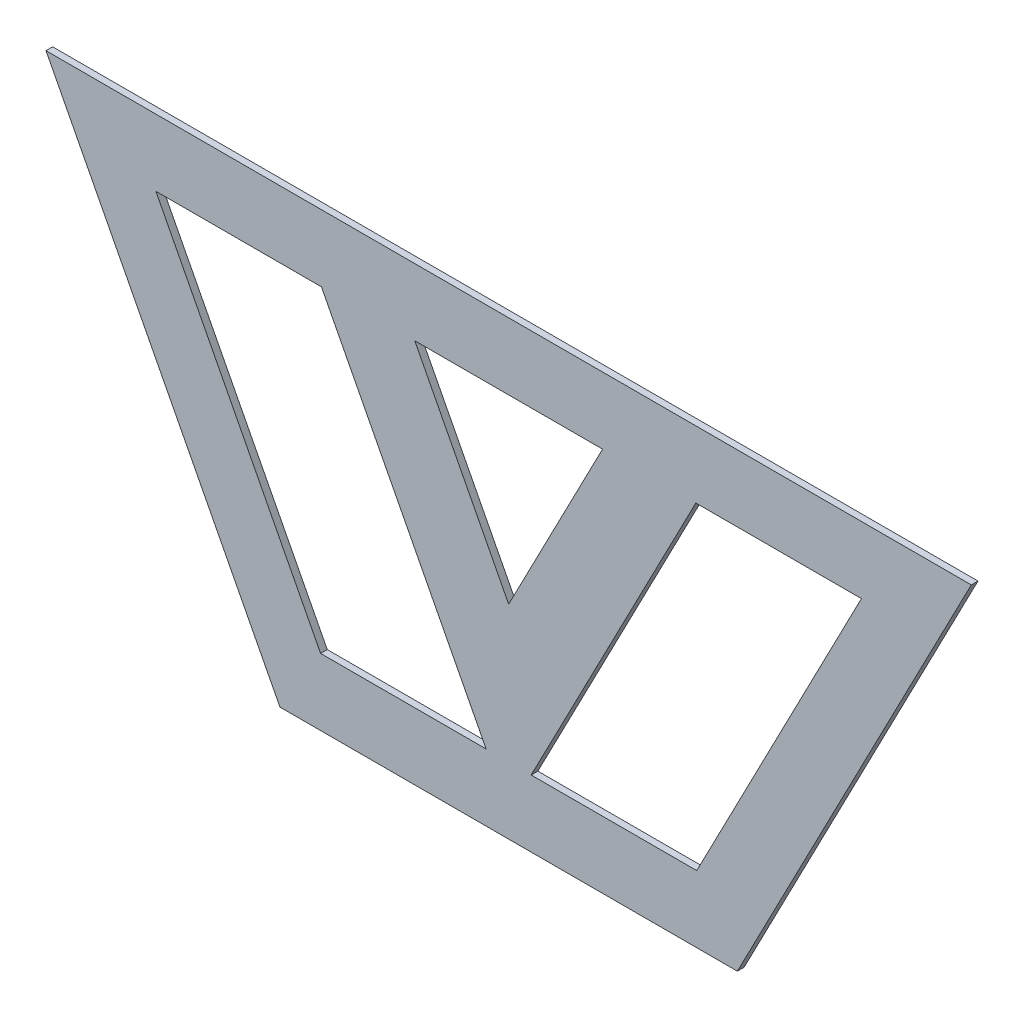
ISO-10303-21;
HEADER;
FILE_DESCRIPTION(('STEP AP214'),'2;1');
FILE_NAME('part.step','',(''),(''),'','','');
FILE_SCHEMA(('AUTOMOTIVE_DESIGN { 1 0 10303 214 1 1 1 1 }'));
ENDSEC;
DATA;
#1=APPLICATION_CONTEXT('core data for automotive mechanical design processes');
#2=APPLICATION_PROTOCOL_DEFINITION('international standard','automotive_design',2000,#1);
#3=PRODUCT_CONTEXT('',#1,'mechanical');
#4=PRODUCT('Part','Part','',(#3));
#5=PRODUCT_RELATED_PRODUCT_CATEGORY('part','',(#4));
#6=PRODUCT_DEFINITION_FORMATION('','',#4);
#7=PRODUCT_DEFINITION_CONTEXT('part definition',#1,'design');
#8=PRODUCT_DEFINITION('design','',#6,#7);
#9=PRODUCT_DEFINITION_SHAPE('','',#8);
#10=(LENGTH_UNIT() NAMED_UNIT(*) SI_UNIT(.MILLI.,.METRE.));
#11=(NAMED_UNIT(*) PLANE_ANGLE_UNIT() SI_UNIT($,.RADIAN.));
#12=(NAMED_UNIT(*) SI_UNIT($,.STERADIAN.) SOLID_ANGLE_UNIT());
#13=UNCERTAINTY_MEASURE_WITH_UNIT(LENGTH_MEASURE(1.E-05),#10,'distance_accuracy_value','');
#14=(GEOMETRIC_REPRESENTATION_CONTEXT(3) GLOBAL_UNCERTAINTY_ASSIGNED_CONTEXT((#13)) GLOBAL_UNIT_ASSIGNED_CONTEXT((#10,
#11,#12)) REPRESENTATION_CONTEXT('',''));
#15=CARTESIAN_POINT('',(0.,0.,0.));
#16=DIRECTION('',(0.,0.,1.));
#17=DIRECTION('',(1.,0.,0.));
#18=AXIS2_PLACEMENT_3D('',#15,#16,#17);
#19=CARTESIAN_POINT('',(0.,0.,6.35));
#20=DIRECTION('',(0.,0.,-1.));
#21=DIRECTION('',(-1.,0.,0.));
#22=AXIS2_PLACEMENT_3D('',#19,#20,#21);
#23=PLANE('',#22);
#24=DIRECTION('',(-1.,0.,0.));
#25=VECTOR('',#24,1.);
#26=CARTESIAN_POINT('',(139.044538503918,978.055735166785,6.35));
#27=LINE('',#26,#25);
#28=CARTESIAN_POINT('',(296.382731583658,978.055735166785,6.35));
#29=VERTEX_POINT('',#28);
#30=CARTESIAN_POINT('',(139.044538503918,978.055735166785,6.35));
#31=VERTEX_POINT('',#30);
#32=EDGE_CURVE('E212',#29,#31,#27,.T.);
#33=ORIENTED_EDGE('',*,*,#32,.F.);
#34=DIRECTION('',(0.460043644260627,0.887896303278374,0.));
#35=VECTOR('',#34,1.);
#36=CARTESIAN_POINT('',(139.867382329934,675.977004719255,6.35));
#37=LINE('',#36,#35);
#38=CARTESIAN_POINT('',(139.867382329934,675.977004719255,6.35));
#39=VERTEX_POINT('',#38);
#40=EDGE_CURVE('E223',#39,#29,#37,.T.);
#41=ORIENTED_EDGE('',*,*,#40,.F.);
#42=DIRECTION('',(1.,0.,0.));
#43=VECTOR('',#42,1.);
#44=CARTESIAN_POINT('',(139.867382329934,675.977004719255,6.35));
#45=LINE('',#44,#43);
#46=CARTESIAN_POINT('',(-17.4708107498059,675.977004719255,6.35));
#47=VERTEX_POINT('',#46);
#48=EDGE_CURVE('E219',#47,#39,#45,.T.);
#49=ORIENTED_EDGE('',*,*,#48,.F.);
#50=DIRECTION('',(-0.460043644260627,-0.887896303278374,0.));
#51=VECTOR('',#50,1.);
#52=CARTESIAN_POINT('',(-17.4708107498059,675.977004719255,6.35));
#53=LINE('',#52,#51);
#54=EDGE_CURVE('E215',#31,#47,#53,.T.);
#55=ORIENTED_EDGE('',*,*,#54,.F.);
#56=EDGE_LOOP('',(#33,#41,#49,#55));
#57=FACE_BOUND('',#56,.T.);
#58=DIRECTION('',(0.460043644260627,0.887896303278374,0.));
#59=VECTOR('',#58,1.);
#60=CARTESIAN_POINT('',(178.48363567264,612.477004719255,6.35));
#61=LINE('',#60,#59);
#62=CARTESIAN_POINT('',(178.48363567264,612.477004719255,6.35));
#63=VERTEX_POINT('',#62);
#64=CARTESIAN_POINT('',(400.801199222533,1041.55573516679,6.35));
#65=VERTEX_POINT('',#64);
#66=EDGE_CURVE('E298',#63,#65,#61,.T.);
#67=ORIENTED_EDGE('',*,*,#66,.T.);
#68=DIRECTION('',(-1.,0.,0.));
#69=VECTOR('',#68,1.);
#70=CARTESIAN_POINT('',(-478.533831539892,1041.55573516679,6.35));
#71=LINE('',#70,#69);
#72=CARTESIAN_POINT('',(-478.533831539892,1041.55573516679,6.35));
#73=VERTEX_POINT('',#72);
#74=EDGE_CURVE('E302',#65,#73,#71,.T.);
#75=ORIENTED_EDGE('',*,*,#74,.T.);
#76=DIRECTION('',(0.460043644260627,-0.887896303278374,0.));
#77=VECTOR('',#76,1.);
#78=CARTESIAN_POINT('',(-256.216267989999,612.477004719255,6.35));
#79=LINE('',#78,#77);
#80=CARTESIAN_POINT('',(-256.216267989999,612.477004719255,6.35));
#81=VERTEX_POINT('',#80);
#82=EDGE_CURVE('E306',#73,#81,#79,.T.);
#83=ORIENTED_EDGE('',*,*,#82,.T.);
#84=DIRECTION('',(1.,0.,0.));
#85=VECTOR('',#84,1.);
#86=CARTESIAN_POINT('',(178.48363567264,612.477004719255,6.35));
#87=LINE('',#86,#85);
#88=EDGE_CURVE('E309',#81,#63,#87,.T.);
#89=ORIENTED_EDGE('',*,*,#88,.T.);
#90=EDGE_LOOP('',(#67,#75,#83,#89));
#91=FACE_BOUND('',#90,.T.);
#92=DIRECTION('',(1.,0.,0.));
#93=VECTOR('',#92,1.);
#94=CARTESIAN_POINT('',(-60.2618215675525,675.977004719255,6.35));
#95=LINE('',#94,#93);
#96=CARTESIAN_POINT('',(-217.600014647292,675.977004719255,6.35));
#97=VERTEX_POINT('',#96);
#98=CARTESIAN_POINT('',(-60.2618215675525,675.977004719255,6.35));
#99=VERTEX_POINT('',#98);
#100=EDGE_CURVE('E255',#97,#99,#95,.T.);
#101=ORIENTED_EDGE('',*,*,#100,.F.);
#102=DIRECTION('',(0.460043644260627,-0.887896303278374,0.));
#103=VECTOR('',#102,1.);
#104=CARTESIAN_POINT('',(-217.600014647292,675.977004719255,6.35));
#105=LINE('',#104,#103);
#106=CARTESIAN_POINT('',(-374.115363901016,978.055735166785,6.35));
#107=VERTEX_POINT('',#106);
#108=EDGE_CURVE('E266',#107,#97,#105,.T.);
#109=ORIENTED_EDGE('',*,*,#108,.F.);
#110=DIRECTION('',(-1.,0.,0.));
#111=VECTOR('',#110,1.);
#112=CARTESIAN_POINT('',(-374.115363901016,978.055735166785,6.35));
#113=LINE('',#112,#111);
#114=CARTESIAN_POINT('',(-216.777170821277,978.055735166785,6.35));
#115=VERTEX_POINT('',#114);
#116=EDGE_CURVE('E262',#115,#107,#113,.T.);
#117=ORIENTED_EDGE('',*,*,#116,.F.);
#118=DIRECTION('',(-0.460043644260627,0.887896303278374,0.));
#119=VECTOR('',#118,1.);
#120=CARTESIAN_POINT('',(-60.2618215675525,675.977004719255,6.35));
#121=LINE('',#120,#119);
#122=EDGE_CURVE('E258',#99,#115,#121,.T.);
#123=ORIENTED_EDGE('',*,*,#122,.F.);
#124=EDGE_LOOP('',(#101,#109,#117,#123));
#125=FACE_BOUND('',#124,.T.);
#126=DIRECTION('',(0.460043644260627,0.887896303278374,0.));
#127=VECTOR('',#126,1.);
#128=CARTESIAN_POINT('',(-38.8663161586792,805.840791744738,6.35));
#129=LINE('',#128,#127);
#130=CARTESIAN_POINT('',(-38.8663161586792,805.840791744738,6.35));
#131=VERTEX_POINT('',#130);
#132=CARTESIAN_POINT('',(50.3630114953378,978.055735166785,6.35));
#133=VERTEX_POINT('',#132);
#134=EDGE_CURVE('E176',#131,#133,#129,.T.);
#135=ORIENTED_EDGE('',*,*,#134,.F.);
#136=DIRECTION('',(0.460043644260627,-0.887896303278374,0.));
#137=VECTOR('',#136,1.);
#138=CARTESIAN_POINT('',(-38.8663161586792,805.840791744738,6.35));
#139=LINE('',#138,#137);
#140=CARTESIAN_POINT('',(-128.095643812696,978.055735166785,6.35));
#141=VERTEX_POINT('',#140);
#142=EDGE_CURVE('E195',#141,#131,#139,.T.);
#143=ORIENTED_EDGE('',*,*,#142,.F.);
#144=DIRECTION('',(-1.,0.,0.));
#145=VECTOR('',#144,1.);
#146=CARTESIAN_POINT('',(-128.095643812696,978.055735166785,6.35));
#147=LINE('',#146,#145);
#148=EDGE_CURVE('E185',#133,#141,#147,.T.);
#149=ORIENTED_EDGE('',*,*,#148,.F.);
#150=EDGE_LOOP('',(#135,#143,#149));
#151=FACE_BOUND('',#150,.T.);
#152=ADVANCED_FACE('F38',(#57,#91,#125,#151),#23,.F.);
#153=CARTESIAN_POINT('',(0.,0.,0.));
#154=DIRECTION('',(0.,0.,-1.));
#155=DIRECTION('',(-1.,0.,0.));
#156=AXIS2_PLACEMENT_3D('',#153,#154,#155);
#157=PLANE('',#156);
#158=DIRECTION('',(0.460043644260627,0.887896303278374,0.));
#159=VECTOR('',#158,1.);
#160=CARTESIAN_POINT('',(178.48363567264,612.477004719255,0.));
#161=LINE('',#160,#159);
#162=CARTESIAN_POINT('',(178.48363567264,612.477004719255,0.));
#163=VERTEX_POINT('',#162);
#164=CARTESIAN_POINT('',(400.801199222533,1041.55573516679,0.));
#165=VERTEX_POINT('',#164);
#166=EDGE_CURVE('E297',#163,#165,#161,.T.);
#167=ORIENTED_EDGE('',*,*,#166,.F.);
#168=DIRECTION('',(1.,0.,0.));
#169=VECTOR('',#168,1.);
#170=CARTESIAN_POINT('',(178.48363567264,612.477004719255,0.));
#171=LINE('',#170,#169);
#172=CARTESIAN_POINT('',(-256.216267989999,612.477004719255,0.));
#173=VERTEX_POINT('',#172);
#174=EDGE_CURVE('E303',#173,#163,#171,.T.);
#175=ORIENTED_EDGE('',*,*,#174,.F.);
#176=DIRECTION('',(0.460043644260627,-0.887896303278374,0.));
#177=VECTOR('',#176,1.);
#178=CARTESIAN_POINT('',(-256.216267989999,612.477004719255,0.));
#179=LINE('',#178,#177);
#180=CARTESIAN_POINT('',(-478.533831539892,1041.55573516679,0.));
#181=VERTEX_POINT('',#180);
#182=EDGE_CURVE('E319',#181,#173,#179,.T.);
#183=ORIENTED_EDGE('',*,*,#182,.F.);
#184=DIRECTION('',(-1.,0.,0.));
#185=VECTOR('',#184,1.);
#186=CARTESIAN_POINT('',(-478.533831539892,1041.55573516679,0.));
#187=LINE('',#186,#185);
#188=EDGE_CURVE('E316',#165,#181,#187,.T.);
#189=ORIENTED_EDGE('',*,*,#188,.F.);
#190=EDGE_LOOP('',(#167,#175,#183,#189));
#191=FACE_BOUND('',#190,.T.);
#192=DIRECTION('',(0.460043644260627,-0.887896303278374,0.));
#193=VECTOR('',#192,1.);
#194=CARTESIAN_POINT('',(-217.600014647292,675.977004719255,0.));
#195=LINE('',#194,#193);
#196=CARTESIAN_POINT('',(-374.115363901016,978.055735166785,0.));
#197=VERTEX_POINT('',#196);
#198=CARTESIAN_POINT('',(-217.600014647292,675.977004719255,0.));
#199=VERTEX_POINT('',#198);
#200=EDGE_CURVE('E259',#197,#199,#195,.T.);
#201=ORIENTED_EDGE('',*,*,#200,.T.);
#202=DIRECTION('',(1.,0.,0.));
#203=VECTOR('',#202,1.);
#204=CARTESIAN_POINT('',(-60.2618215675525,675.977004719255,0.));
#205=LINE('',#204,#203);
#206=CARTESIAN_POINT('',(-60.2618215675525,675.977004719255,0.));
#207=VERTEX_POINT('',#206);
#208=EDGE_CURVE('E254',#199,#207,#205,.T.);
#209=ORIENTED_EDGE('',*,*,#208,.T.);
#210=DIRECTION('',(-0.460043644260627,0.887896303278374,0.));
#211=VECTOR('',#210,1.);
#212=CARTESIAN_POINT('',(-60.2618215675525,675.977004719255,0.));
#213=LINE('',#212,#211);
#214=CARTESIAN_POINT('',(-216.777170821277,978.055735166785,0.));
#215=VERTEX_POINT('',#214);
#216=EDGE_CURVE('E273',#207,#215,#213,.T.);
#217=ORIENTED_EDGE('',*,*,#216,.T.);
#218=DIRECTION('',(-1.,0.,0.));
#219=VECTOR('',#218,1.);
#220=CARTESIAN_POINT('',(-374.115363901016,978.055735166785,0.));
#221=LINE('',#220,#219);
#222=EDGE_CURVE('E277',#215,#197,#221,.T.);
#223=ORIENTED_EDGE('',*,*,#222,.T.);
#224=EDGE_LOOP('',(#201,#209,#217,#223));
#225=FACE_BOUND('',#224,.T.);
#226=DIRECTION('',(0.460043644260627,0.887896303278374,0.));
#227=VECTOR('',#226,1.);
#228=CARTESIAN_POINT('',(139.867382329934,675.977004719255,0.));
#229=LINE('',#228,#227);
#230=CARTESIAN_POINT('',(139.867382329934,675.977004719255,0.));
#231=VERTEX_POINT('',#230);
#232=CARTESIAN_POINT('',(296.382731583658,978.055735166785,0.));
#233=VERTEX_POINT('',#232);
#234=EDGE_CURVE('E216',#231,#233,#229,.T.);
#235=ORIENTED_EDGE('',*,*,#234,.T.);
#236=DIRECTION('',(-1.,0.,0.));
#237=VECTOR('',#236,1.);
#238=CARTESIAN_POINT('',(139.044538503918,978.055735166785,0.));
#239=LINE('',#238,#237);
#240=CARTESIAN_POINT('',(139.044538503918,978.055735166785,0.));
#241=VERTEX_POINT('',#240);
#242=EDGE_CURVE('E193',#233,#241,#239,.T.);
#243=ORIENTED_EDGE('',*,*,#242,.T.);
#244=DIRECTION('',(-0.460043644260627,-0.887896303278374,0.));
#245=VECTOR('',#244,1.);
#246=CARTESIAN_POINT('',(-17.4708107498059,675.977004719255,0.));
#247=LINE('',#246,#245);
#248=CARTESIAN_POINT('',(-17.4708107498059,675.977004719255,0.));
#249=VERTEX_POINT('',#248);
#250=EDGE_CURVE('E230',#241,#249,#247,.T.);
#251=ORIENTED_EDGE('',*,*,#250,.T.);
#252=DIRECTION('',(1.,0.,0.));
#253=VECTOR('',#252,1.);
#254=CARTESIAN_POINT('',(139.867382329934,675.977004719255,0.));
#255=LINE('',#254,#253);
#256=EDGE_CURVE('E234',#249,#231,#255,.T.);
#257=ORIENTED_EDGE('',*,*,#256,.T.);
#258=EDGE_LOOP('',(#235,#243,#251,#257));
#259=FACE_BOUND('',#258,.T.);
#260=DIRECTION('',(0.460043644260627,-0.887896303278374,0.));
#261=VECTOR('',#260,1.);
#262=CARTESIAN_POINT('',(-38.8663161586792,805.840791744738,0.));
#263=LINE('',#262,#261);
#264=CARTESIAN_POINT('',(-128.095643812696,978.055735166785,0.));
#265=VERTEX_POINT('',#264);
#266=CARTESIAN_POINT('',(-38.8663161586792,805.840791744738,0.));
#267=VERTEX_POINT('',#266);
#268=EDGE_CURVE('E186',#265,#267,#263,.T.);
#269=ORIENTED_EDGE('',*,*,#268,.T.);
#270=DIRECTION('',(0.460043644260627,0.887896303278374,0.));
#271=VECTOR('',#270,1.);
#272=CARTESIAN_POINT('',(-38.8663161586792,805.840791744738,0.));
#273=LINE('',#272,#271);
#274=CARTESIAN_POINT('',(50.3630114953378,978.055735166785,0.));
#275=VERTEX_POINT('',#274);
#276=EDGE_CURVE('E68',#267,#275,#273,.T.);
#277=ORIENTED_EDGE('',*,*,#276,.T.);
#278=DIRECTION('',(-1.,0.,0.));
#279=VECTOR('',#278,1.);
#280=CARTESIAN_POINT('',(-128.095643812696,978.055735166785,0.));
#281=LINE('',#280,#279);
#282=EDGE_CURVE('E191',#275,#265,#281,.T.);
#283=ORIENTED_EDGE('',*,*,#282,.T.);
#284=EDGE_LOOP('',(#269,#277,#283));
#285=FACE_BOUND('',#284,.T.);
#286=ADVANCED_FACE('F342',(#191,#225,#259,#285),#157,.T.);
#287=CARTESIAN_POINT('',(178.48363567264,612.477004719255,6.35));
#288=DIRECTION('',(-0.887896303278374,0.460043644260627,0.));
#289=DIRECTION('',(-0.460043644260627,-0.887896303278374,0.));
#290=AXIS2_PLACEMENT_3D('',#287,#288,#289);
#291=PLANE('',#290);
#292=ORIENTED_EDGE('',*,*,#166,.T.);
#293=DIRECTION('',(0.,0.,-1.));
#294=VECTOR('',#293,1.);
#295=CARTESIAN_POINT('',(400.801199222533,1041.55573516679,6.35));
#296=LINE('',#295,#294);
#297=EDGE_CURVE('E11',#65,#165,#296,.T.);
#298=ORIENTED_EDGE('',*,*,#297,.F.);
#299=ORIENTED_EDGE('',*,*,#66,.F.);
#300=DIRECTION('',(0.,0.,-1.));
#301=VECTOR('',#300,1.);
#302=CARTESIAN_POINT('',(178.48363567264,612.477004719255,6.35));
#303=LINE('',#302,#301);
#304=EDGE_CURVE('E312',#63,#163,#303,.T.);
#305=ORIENTED_EDGE('',*,*,#304,.T.);
#306=EDGE_LOOP('',(#292,#298,#299,#305));
#307=FACE_BOUND('',#306,.T.);
#308=ADVANCED_FACE('F40',(#307),#291,.F.);
#309=CARTESIAN_POINT('',(-478.533831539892,1041.55573516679,6.35));
#310=DIRECTION('',(0.,-1.,0.));
#311=DIRECTION('',(0.,0.,-1.));
#312=AXIS2_PLACEMENT_3D('',#309,#310,#311);
#313=PLANE('',#312);
#314=ORIENTED_EDGE('',*,*,#188,.T.);
#315=DIRECTION('',(0.,0.,-1.));
#316=VECTOR('',#315,1.);
#317=CARTESIAN_POINT('',(-478.533831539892,1041.55573516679,6.35));
#318=LINE('',#317,#316);
#319=EDGE_CURVE('E47',#73,#181,#318,.T.);
#320=ORIENTED_EDGE('',*,*,#319,.F.);
#321=ORIENTED_EDGE('',*,*,#74,.F.);
#322=ORIENTED_EDGE('',*,*,#297,.T.);
#323=EDGE_LOOP('',(#314,#320,#321,#322));
#324=FACE_BOUND('',#323,.T.);
#325=ADVANCED_FACE('F353',(#324),#313,.F.);
#326=CARTESIAN_POINT('',(-256.216267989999,612.477004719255,6.35));
#327=DIRECTION('',(0.887896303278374,0.460043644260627,0.));
#328=DIRECTION('',(-0.460043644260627,0.887896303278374,0.));
#329=AXIS2_PLACEMENT_3D('',#326,#327,#328);
#330=PLANE('',#329);
#331=ORIENTED_EDGE('',*,*,#182,.T.);
#332=DIRECTION('',(0.,0.,-1.));
#333=VECTOR('',#332,1.);
#334=CARTESIAN_POINT('',(-256.216267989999,612.477004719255,6.35));
#335=LINE('',#334,#333);
#336=EDGE_CURVE('E327',#81,#173,#335,.T.);
#337=ORIENTED_EDGE('',*,*,#336,.F.);
#338=ORIENTED_EDGE('',*,*,#82,.F.);
#339=ORIENTED_EDGE('',*,*,#319,.T.);
#340=EDGE_LOOP('',(#331,#337,#338,#339));
#341=FACE_BOUND('',#340,.T.);
#342=ADVANCED_FACE('F336',(#341),#330,.F.);
#343=CARTESIAN_POINT('',(178.48363567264,612.477004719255,6.35));
#344=DIRECTION('',(0.,1.,0.));
#345=DIRECTION('',(0.,0.,1.));
#346=AXIS2_PLACEMENT_3D('',#343,#344,#345);
#347=PLANE('',#346);
#348=ORIENTED_EDGE('',*,*,#174,.T.);
#349=ORIENTED_EDGE('',*,*,#304,.F.);
#350=ORIENTED_EDGE('',*,*,#88,.F.);
#351=ORIENTED_EDGE('',*,*,#336,.T.);
#352=EDGE_LOOP('',(#348,#349,#350,#351));
#353=FACE_BOUND('',#352,.T.);
#354=ADVANCED_FACE('F346',(#353),#347,.F.);
#355=CARTESIAN_POINT('',(-60.2618215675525,675.977004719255,6.35));
#356=DIRECTION('',(0.,1.,0.));
#357=DIRECTION('',(0.,0.,1.));
#358=AXIS2_PLACEMENT_3D('',#355,#356,#357);
#359=PLANE('',#358);
#360=ORIENTED_EDGE('',*,*,#208,.F.);
#361=DIRECTION('',(0.,0.,-1.));
#362=VECTOR('',#361,1.);
#363=CARTESIAN_POINT('',(-217.600014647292,675.977004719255,6.35));
#364=LINE('',#363,#362);
#365=EDGE_CURVE('E269',#97,#199,#364,.T.);
#366=ORIENTED_EDGE('',*,*,#365,.F.);
#367=ORIENTED_EDGE('',*,*,#100,.T.);
#368=DIRECTION('',(0.,0.,-1.));
#369=VECTOR('',#368,1.);
#370=CARTESIAN_POINT('',(-60.2618215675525,675.977004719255,6.35));
#371=LINE('',#370,#369);
#372=EDGE_CURVE('E293',#99,#207,#371,.T.);
#373=ORIENTED_EDGE('',*,*,#372,.T.);
#374=EDGE_LOOP('',(#360,#366,#367,#373));
#375=FACE_BOUND('',#374,.T.);
#376=ADVANCED_FACE('F369',(#375),#359,.T.);
#377=CARTESIAN_POINT('',(-60.2618215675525,675.977004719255,6.35));
#378=DIRECTION('',(-0.887896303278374,-0.460043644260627,0.));
#379=DIRECTION('',(0.460043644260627,-0.887896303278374,0.));
#380=AXIS2_PLACEMENT_3D('',#377,#378,#379);
#381=PLANE('',#380);
#382=ORIENTED_EDGE('',*,*,#216,.F.);
#383=ORIENTED_EDGE('',*,*,#372,.F.);
#384=ORIENTED_EDGE('',*,*,#122,.T.);
#385=DIRECTION('',(0.,0.,-1.));
#386=VECTOR('',#385,1.);
#387=CARTESIAN_POINT('',(-216.777170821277,978.055735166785,6.35));
#388=LINE('',#387,#386);
#389=EDGE_CURVE('E290',#115,#215,#388,.T.);
#390=ORIENTED_EDGE('',*,*,#389,.T.);
#391=EDGE_LOOP('',(#382,#383,#384,#390));
#392=FACE_BOUND('',#391,.T.);
#393=ADVANCED_FACE('F376',(#392),#381,.T.);
#394=CARTESIAN_POINT('',(-374.115363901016,978.055735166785,6.35));
#395=DIRECTION('',(0.,-1.,0.));
#396=DIRECTION('',(1.,0.,0.));
#397=AXIS2_PLACEMENT_3D('',#394,#395,#396);
#398=PLANE('',#397);
#399=ORIENTED_EDGE('',*,*,#222,.F.);
#400=ORIENTED_EDGE('',*,*,#389,.F.);
#401=ORIENTED_EDGE('',*,*,#116,.T.);
#402=DIRECTION('',(0.,0.,-1.));
#403=VECTOR('',#402,1.);
#404=CARTESIAN_POINT('',(-374.115363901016,978.055735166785,6.35));
#405=LINE('',#404,#403);
#406=EDGE_CURVE('E287',#107,#197,#405,.T.);
#407=ORIENTED_EDGE('',*,*,#406,.T.);
#408=EDGE_LOOP('',(#399,#400,#401,#407));
#409=FACE_BOUND('',#408,.T.);
#410=ADVANCED_FACE('F381',(#409),#398,.T.);
#411=CARTESIAN_POINT('',(-217.600014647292,675.977004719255,6.35));
#412=DIRECTION('',(0.887896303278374,0.460043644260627,0.));
#413=DIRECTION('',(-0.460043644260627,0.887896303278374,0.));
#414=AXIS2_PLACEMENT_3D('',#411,#412,#413);
#415=PLANE('',#414);
#416=ORIENTED_EDGE('',*,*,#200,.F.);
#417=ORIENTED_EDGE('',*,*,#406,.F.);
#418=ORIENTED_EDGE('',*,*,#108,.T.);
#419=ORIENTED_EDGE('',*,*,#365,.T.);
#420=EDGE_LOOP('',(#416,#417,#418,#419));
#421=FACE_BOUND('',#420,.T.);
#422=ADVANCED_FACE('F388',(#421),#415,.T.);
#423=CARTESIAN_POINT('',(139.044538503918,978.055735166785,6.35));
#424=DIRECTION('',(0.,-1.,0.));
#425=DIRECTION('',(1.,0.,0.));
#426=AXIS2_PLACEMENT_3D('',#423,#424,#425);
#427=PLANE('',#426);
#428=ORIENTED_EDGE('',*,*,#242,.F.);
#429=DIRECTION('',(0.,0.,-1.));
#430=VECTOR('',#429,1.);
#431=CARTESIAN_POINT('',(296.382731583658,978.055735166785,6.35));
#432=LINE('',#431,#430);
#433=EDGE_CURVE('E226',#29,#233,#432,.T.);
#434=ORIENTED_EDGE('',*,*,#433,.F.);
#435=ORIENTED_EDGE('',*,*,#32,.T.);
#436=DIRECTION('',(0.,0.,-1.));
#437=VECTOR('',#436,1.);
#438=CARTESIAN_POINT('',(139.044538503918,978.055735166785,6.35));
#439=LINE('',#438,#437);
#440=EDGE_CURVE('E250',#31,#241,#439,.T.);
#441=ORIENTED_EDGE('',*,*,#440,.T.);
#442=EDGE_LOOP('',(#428,#434,#435,#441));
#443=FACE_BOUND('',#442,.T.);
#444=ADVANCED_FACE('F401',(#443),#427,.T.);
#445=CARTESIAN_POINT('',(-17.4708107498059,675.977004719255,6.35));
#446=DIRECTION('',(0.887896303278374,-0.460043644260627,0.));
#447=DIRECTION('',(0.460043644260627,0.887896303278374,0.));
#448=AXIS2_PLACEMENT_3D('',#445,#446,#447);
#449=PLANE('',#448);
#450=ORIENTED_EDGE('',*,*,#250,.F.);
#451=ORIENTED_EDGE('',*,*,#440,.F.);
#452=ORIENTED_EDGE('',*,*,#54,.T.);
#453=DIRECTION('',(0.,0.,-1.));
#454=VECTOR('',#453,1.);
#455=CARTESIAN_POINT('',(-17.4708107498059,675.977004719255,6.35));
#456=LINE('',#455,#454);
#457=EDGE_CURVE('E247',#47,#249,#456,.T.);
#458=ORIENTED_EDGE('',*,*,#457,.T.);
#459=EDGE_LOOP('',(#450,#451,#452,#458));
#460=FACE_BOUND('',#459,.T.);
#461=ADVANCED_FACE('F406',(#460),#449,.T.);
#462=CARTESIAN_POINT('',(139.867382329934,675.977004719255,6.35));
#463=DIRECTION('',(0.,1.,0.));
#464=DIRECTION('',(0.,0.,1.));
#465=AXIS2_PLACEMENT_3D('',#462,#463,#464);
#466=PLANE('',#465);
#467=ORIENTED_EDGE('',*,*,#256,.F.);
#468=ORIENTED_EDGE('',*,*,#457,.F.);
#469=ORIENTED_EDGE('',*,*,#48,.T.);
#470=DIRECTION('',(0.,0.,-1.));
#471=VECTOR('',#470,1.);
#472=CARTESIAN_POINT('',(139.867382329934,675.977004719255,6.35));
#473=LINE('',#472,#471);
#474=EDGE_CURVE('E244',#39,#231,#473,.T.);
#475=ORIENTED_EDGE('',*,*,#474,.T.);
#476=EDGE_LOOP('',(#467,#468,#469,#475));
#477=FACE_BOUND('',#476,.T.);
#478=ADVANCED_FACE('F410',(#477),#466,.T.);
#479=CARTESIAN_POINT('',(139.867382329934,675.977004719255,6.35));
#480=DIRECTION('',(-0.887896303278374,0.460043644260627,0.));
#481=DIRECTION('',(-0.460043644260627,-0.887896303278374,0.));
#482=AXIS2_PLACEMENT_3D('',#479,#480,#481);
#483=PLANE('',#482);
#484=ORIENTED_EDGE('',*,*,#234,.F.);
#485=ORIENTED_EDGE('',*,*,#474,.F.);
#486=ORIENTED_EDGE('',*,*,#40,.T.);
#487=ORIENTED_EDGE('',*,*,#433,.T.);
#488=EDGE_LOOP('',(#484,#485,#486,#487));
#489=FACE_BOUND('',#488,.T.);
#490=ADVANCED_FACE('F414',(#489),#483,.T.);
#491=CARTESIAN_POINT('',(-38.8663161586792,805.840791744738,6.35));
#492=DIRECTION('',(-0.887896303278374,0.460043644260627,0.));
#493=DIRECTION('',(-0.460043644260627,-0.887896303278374,0.));
#494=AXIS2_PLACEMENT_3D('',#491,#492,#493);
#495=PLANE('',#494);
#496=ORIENTED_EDGE('',*,*,#276,.F.);
#497=DIRECTION('',(0.,0.,-1.));
#498=VECTOR('',#497,1.);
#499=CARTESIAN_POINT('',(-38.8663161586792,805.840791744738,6.35));
#500=LINE('',#499,#498);
#501=EDGE_CURVE('E180',#131,#267,#500,.T.);
#502=ORIENTED_EDGE('',*,*,#501,.F.);
#503=ORIENTED_EDGE('',*,*,#134,.T.);
#504=DIRECTION('',(0.,0.,-1.));
#505=VECTOR('',#504,1.);
#506=CARTESIAN_POINT('',(50.3630114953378,978.055735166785,6.35));
#507=LINE('',#506,#505);
#508=EDGE_CURVE('E179',#133,#275,#507,.T.);
#509=ORIENTED_EDGE('',*,*,#508,.T.);
#510=EDGE_LOOP('',(#496,#502,#503,#509));
#511=FACE_BOUND('',#510,.T.);
#512=ADVANCED_FACE('F178',(#511),#495,.T.);
#513=CARTESIAN_POINT('',(-128.095643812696,978.055735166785,6.35));
#514=DIRECTION('',(0.,-1.,0.));
#515=DIRECTION('',(0.,0.,-1.));
#516=AXIS2_PLACEMENT_3D('',#513,#514,#515);
#517=PLANE('',#516);
#518=ORIENTED_EDGE('',*,*,#282,.F.);
#519=ORIENTED_EDGE('',*,*,#508,.F.);
#520=ORIENTED_EDGE('',*,*,#148,.T.);
#521=DIRECTION('',(0.,0.,-1.));
#522=VECTOR('',#521,1.);
#523=CARTESIAN_POINT('',(-128.095643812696,978.055735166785,6.35));
#524=LINE('',#523,#522);
#525=EDGE_CURVE('E57',#141,#265,#524,.T.);
#526=ORIENTED_EDGE('',*,*,#525,.T.);
#527=EDGE_LOOP('',(#518,#519,#520,#526));
#528=FACE_BOUND('',#527,.T.);
#529=ADVANCED_FACE('F189',(#528),#517,.T.);
#530=CARTESIAN_POINT('',(-38.8663161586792,805.840791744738,6.35));
#531=DIRECTION('',(0.887896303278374,0.460043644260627,0.));
#532=DIRECTION('',(-0.460043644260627,0.887896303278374,0.));
#533=AXIS2_PLACEMENT_3D('',#530,#531,#532);
#534=PLANE('',#533);
#535=ORIENTED_EDGE('',*,*,#268,.F.);
#536=ORIENTED_EDGE('',*,*,#525,.F.);
#537=ORIENTED_EDGE('',*,*,#142,.T.);
#538=ORIENTED_EDGE('',*,*,#501,.T.);
#539=EDGE_LOOP('',(#535,#536,#537,#538));
#540=FACE_BOUND('',#539,.T.);
#541=ADVANCED_FACE('F423',(#540),#534,.T.);
#542=CLOSED_SHELL('',(#152,#286,#308,#325,#342,#354,#376,#393,#410,#422,#444,#461,#478,#490,
#512,#529,#541));
#543=MANIFOLD_SOLID_BREP('B2',#542);
#544=ADVANCED_BREP_SHAPE_REPRESENTATION('',(#18,#543),#14);
#545=SHAPE_DEFINITION_REPRESENTATION(#9,#544);
ENDSEC;
END-ISO-10303-21;
